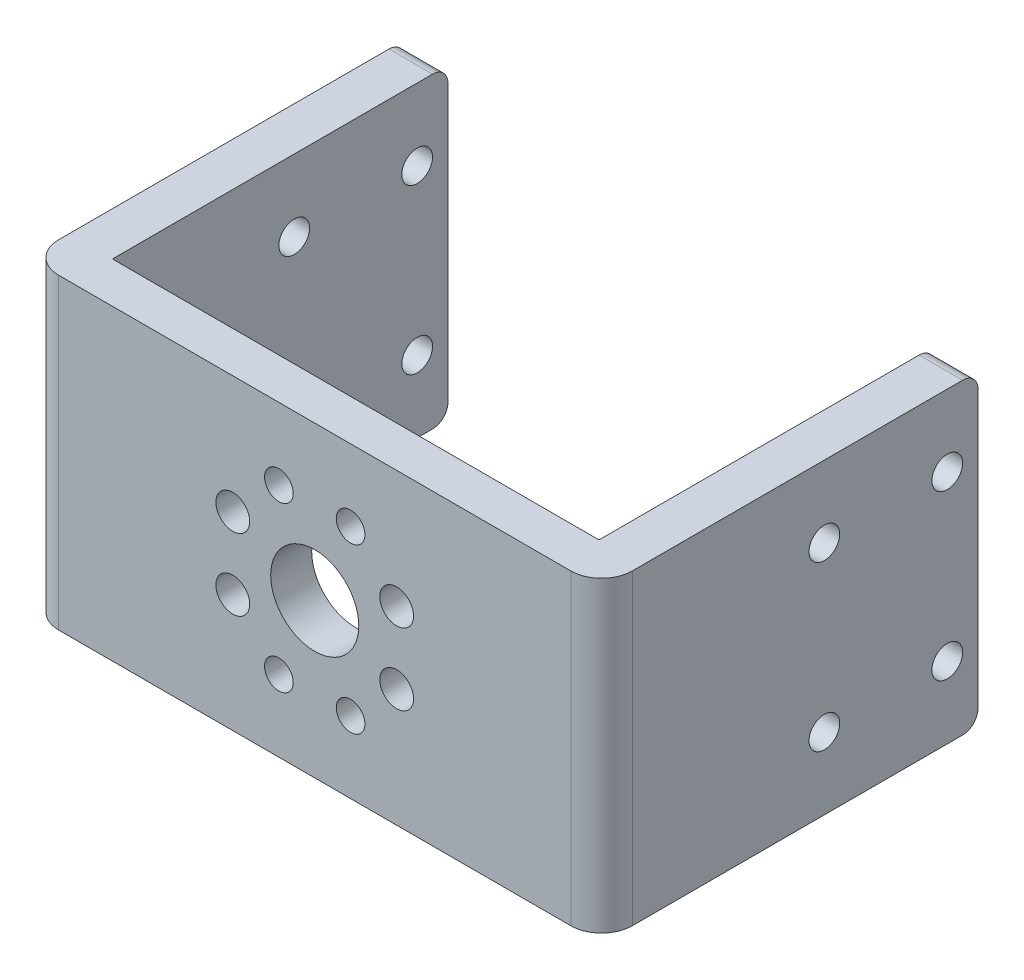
ISO-10303-21;
HEADER;
FILE_DESCRIPTION(('STEP AP214'),'2;1');
FILE_NAME('part.step','',(''),(''),'','','');
FILE_SCHEMA(('AUTOMOTIVE_DESIGN { 1 0 10303 214 1 1 1 1 }'));
ENDSEC;
DATA;
#1=APPLICATION_CONTEXT('core data for automotive mechanical design processes');
#2=APPLICATION_PROTOCOL_DEFINITION('international standard','automotive_design',2000,#1);
#3=PRODUCT_CONTEXT('',#1,'mechanical');
#4=PRODUCT('Part','Part','',(#3));
#5=PRODUCT_RELATED_PRODUCT_CATEGORY('part','',(#4));
#6=PRODUCT_DEFINITION_FORMATION('','',#4);
#7=PRODUCT_DEFINITION_CONTEXT('part definition',#1,'design');
#8=PRODUCT_DEFINITION('design','',#6,#7);
#9=PRODUCT_DEFINITION_SHAPE('','',#8);
#10=(LENGTH_UNIT() NAMED_UNIT(*) SI_UNIT(.MILLI.,.METRE.));
#11=(NAMED_UNIT(*) PLANE_ANGLE_UNIT() SI_UNIT($,.RADIAN.));
#12=(NAMED_UNIT(*) SI_UNIT($,.STERADIAN.) SOLID_ANGLE_UNIT());
#13=UNCERTAINTY_MEASURE_WITH_UNIT(LENGTH_MEASURE(1.E-05),#10,'distance_accuracy_value','');
#14=(GEOMETRIC_REPRESENTATION_CONTEXT(3) GLOBAL_UNCERTAINTY_ASSIGNED_CONTEXT((#13)) GLOBAL_UNIT_ASSIGNED_CONTEXT((#10,
#11,#12)) REPRESENTATION_CONTEXT('',''));
#15=CARTESIAN_POINT('',(0.,0.,0.));
#16=DIRECTION('',(0.,0.,1.));
#17=DIRECTION('',(1.,0.,0.));
#18=AXIS2_PLACEMENT_3D('',#15,#16,#17);
#19=CARTESIAN_POINT('',(23.75,13.5,-32.75));
#20=DIRECTION('',(-1.,0.,0.));
#21=DIRECTION('',(0.,0.,1.));
#22=AXIS2_PLACEMENT_3D('',#19,#20,#21);
#23=PLANE('',#22);
#24=CARTESIAN_POINT('',(23.75,-8.,-31.25));
#25=DIRECTION('',(-1.,0.,0.));
#26=DIRECTION('',(0.,0.,1.));
#27=AXIS2_PLACEMENT_3D('',#24,#25,#26);
#28=CIRCLE('',#27,1.5);
#29=CARTESIAN_POINT('',(23.75,-8.,-29.75));
#30=VERTEX_POINT('',#29);
#31=EDGE_CURVE('E380',#30,#30,#28,.T.);
#32=ORIENTED_EDGE('',*,*,#31,.F.);
#33=EDGE_LOOP('',(#32));
#34=FACE_BOUND('',#33,.T.);
#35=CARTESIAN_POINT('',(23.75,8.,-19.25));
#36=DIRECTION('',(-1.,0.,0.));
#37=DIRECTION('',(0.,0.,1.));
#38=AXIS2_PLACEMENT_3D('',#35,#36,#37);
#39=CIRCLE('',#38,1.5);
#40=CARTESIAN_POINT('',(23.75,8.,-17.75));
#41=VERTEX_POINT('',#40);
#42=EDGE_CURVE('E218',#41,#41,#39,.T.);
#43=ORIENTED_EDGE('',*,*,#42,.F.);
#44=EDGE_LOOP('',(#43));
#45=FACE_BOUND('',#44,.T.);
#46=CARTESIAN_POINT('',(23.75,-8.,-19.25));
#47=DIRECTION('',(-1.,0.,0.));
#48=DIRECTION('',(0.,0.,1.));
#49=AXIS2_PLACEMENT_3D('',#46,#47,#48);
#50=CIRCLE('',#49,1.5);
#51=CARTESIAN_POINT('',(23.75,-8.,-17.75));
#52=VERTEX_POINT('',#51);
#53=EDGE_CURVE('E222',#52,#52,#50,.T.);
#54=ORIENTED_EDGE('',*,*,#53,.F.);
#55=EDGE_LOOP('',(#54));
#56=FACE_BOUND('',#55,.T.);
#57=CARTESIAN_POINT('',(23.75,8.,-31.25));
#58=DIRECTION('',(-1.,0.,0.));
#59=DIRECTION('',(0.,0.,1.));
#60=AXIS2_PLACEMENT_3D('',#57,#58,#59);
#61=CIRCLE('',#60,1.5);
#62=CARTESIAN_POINT('',(23.75,8.,-29.75));
#63=VERTEX_POINT('',#62);
#64=EDGE_CURVE('E435',#63,#63,#61,.T.);
#65=ORIENTED_EDGE('',*,*,#64,.F.);
#66=EDGE_LOOP('',(#65));
#67=FACE_BOUND('',#66,.T.);
#68=DIRECTION('',(0.,1.,0.));
#69=VECTOR('',#68,1.);
#70=CARTESIAN_POINT('',(23.75,-15.,-1.5));
#71=LINE('',#70,#69);
#72=CARTESIAN_POINT('',(23.75,-15.,-1.5));
#73=VERTEX_POINT('',#72);
#74=CARTESIAN_POINT('',(23.75,15.,-1.5));
#75=VERTEX_POINT('',#74);
#76=EDGE_CURVE('E293',#73,#75,#71,.T.);
#77=ORIENTED_EDGE('',*,*,#76,.T.);
#78=DIRECTION('',(0.,0.,-1.));
#79=VECTOR('',#78,1.);
#80=CARTESIAN_POINT('',(23.75,15.,-1.5));
#81=LINE('',#80,#79);
#82=CARTESIAN_POINT('',(23.75,15.,-32.75));
#83=VERTEX_POINT('',#82);
#84=EDGE_CURVE('E242',#75,#83,#81,.T.);
#85=ORIENTED_EDGE('',*,*,#84,.T.);
#86=CARTESIAN_POINT('',(23.75,13.5,-32.75));
#87=DIRECTION('',(-1.,0.,0.));
#88=DIRECTION('',(0.,0.,1.));
#89=AXIS2_PLACEMENT_3D('',#86,#87,#88);
#90=CIRCLE('',#89,1.5);
#91=CARTESIAN_POINT('',(23.75,13.5,-34.25));
#92=VERTEX_POINT('',#91);
#93=EDGE_CURVE('E49',#83,#92,#90,.T.);
#94=ORIENTED_EDGE('',*,*,#93,.T.);
#95=DIRECTION('',(0.,-1.,0.));
#96=VECTOR('',#95,1.);
#97=CARTESIAN_POINT('',(23.75,13.5,-34.25));
#98=LINE('',#97,#96);
#99=CARTESIAN_POINT('',(23.75,-13.5,-34.25));
#100=VERTEX_POINT('',#99);
#101=EDGE_CURVE('E274',#92,#100,#98,.T.);
#102=ORIENTED_EDGE('',*,*,#101,.T.);
#103=CARTESIAN_POINT('',(23.75,-13.5,-32.75));
#104=DIRECTION('',(-1.,0.,0.));
#105=DIRECTION('',(0.,0.,1.));
#106=AXIS2_PLACEMENT_3D('',#103,#104,#105);
#107=CIRCLE('',#106,1.5);
#108=CARTESIAN_POINT('',(23.75,-15.,-32.75));
#109=VERTEX_POINT('',#108);
#110=EDGE_CURVE('E280',#100,#109,#107,.T.);
#111=ORIENTED_EDGE('',*,*,#110,.T.);
#112=DIRECTION('',(0.,0.,1.));
#113=VECTOR('',#112,1.);
#114=CARTESIAN_POINT('',(23.75,-15.,-32.75));
#115=LINE('',#114,#113);
#116=EDGE_CURVE('E213',#109,#73,#115,.T.);
#117=ORIENTED_EDGE('',*,*,#116,.T.);
#118=EDGE_LOOP('',(#77,#85,#94,#102,#111,#117));
#119=FACE_BOUND('',#118,.T.);
#120=ADVANCED_FACE('F17',(#34,#45,#56,#67,#119),#23,.T.);
#121=CARTESIAN_POINT('',(-23.75,-13.5,-32.75));
#122=DIRECTION('',(1.,0.,0.));
#123=DIRECTION('',(0.,1.,0.));
#124=AXIS2_PLACEMENT_3D('',#121,#122,#123);
#125=PLANE('',#124);
#126=CARTESIAN_POINT('',(-23.75,-8.,-19.25));
#127=DIRECTION('',(1.,0.,0.));
#128=DIRECTION('',(0.,0.,-1.));
#129=AXIS2_PLACEMENT_3D('',#126,#127,#128);
#130=CIRCLE('',#129,1.5);
#131=CARTESIAN_POINT('',(-23.75,-8.,-20.75));
#132=VERTEX_POINT('',#131);
#133=EDGE_CURVE('E201',#132,#132,#130,.T.);
#134=ORIENTED_EDGE('',*,*,#133,.F.);
#135=EDGE_LOOP('',(#134));
#136=FACE_BOUND('',#135,.T.);
#137=CARTESIAN_POINT('',(-23.75,8.,-31.25));
#138=DIRECTION('',(1.,0.,0.));
#139=DIRECTION('',(0.,0.,-1.));
#140=AXIS2_PLACEMENT_3D('',#137,#138,#139);
#141=CIRCLE('',#140,1.5);
#142=CARTESIAN_POINT('',(-23.75,8.,-32.75));
#143=VERTEX_POINT('',#142);
#144=EDGE_CURVE('E195',#143,#143,#141,.T.);
#145=ORIENTED_EDGE('',*,*,#144,.F.);
#146=EDGE_LOOP('',(#145));
#147=FACE_BOUND('',#146,.T.);
#148=CARTESIAN_POINT('',(-23.75,8.,-19.25));
#149=DIRECTION('',(1.,0.,0.));
#150=DIRECTION('',(0.,0.,-1.));
#151=AXIS2_PLACEMENT_3D('',#148,#149,#150);
#152=CIRCLE('',#151,1.5);
#153=CARTESIAN_POINT('',(-23.75,8.,-20.75));
#154=VERTEX_POINT('',#153);
#155=EDGE_CURVE('E202',#154,#154,#152,.T.);
#156=ORIENTED_EDGE('',*,*,#155,.F.);
#157=EDGE_LOOP('',(#156));
#158=FACE_BOUND('',#157,.T.);
#159=CARTESIAN_POINT('',(-23.75,-8.,-31.25));
#160=DIRECTION('',(1.,0.,0.));
#161=DIRECTION('',(0.,0.,-1.));
#162=AXIS2_PLACEMENT_3D('',#159,#160,#161);
#163=CIRCLE('',#162,1.5);
#164=CARTESIAN_POINT('',(-23.75,-8.,-32.75));
#165=VERTEX_POINT('',#164);
#166=EDGE_CURVE('E398',#165,#165,#163,.T.);
#167=ORIENTED_EDGE('',*,*,#166,.F.);
#168=EDGE_LOOP('',(#167));
#169=FACE_BOUND('',#168,.T.);
#170=DIRECTION('',(0.,-1.,0.));
#171=VECTOR('',#170,1.);
#172=CARTESIAN_POINT('',(-23.75,15.,-1.5));
#173=LINE('',#172,#171);
#174=CARTESIAN_POINT('',(-23.75,15.,-1.5));
#175=VERTEX_POINT('',#174);
#176=CARTESIAN_POINT('',(-23.75,-15.,-1.5));
#177=VERTEX_POINT('',#176);
#178=EDGE_CURVE('E296',#175,#177,#173,.T.);
#179=ORIENTED_EDGE('',*,*,#178,.T.);
#180=DIRECTION('',(0.,0.,-1.));
#181=VECTOR('',#180,1.);
#182=CARTESIAN_POINT('',(-23.75,-15.,-1.5));
#183=LINE('',#182,#181);
#184=CARTESIAN_POINT('',(-23.75,-15.,-32.75));
#185=VERTEX_POINT('',#184);
#186=EDGE_CURVE('E263',#177,#185,#183,.T.);
#187=ORIENTED_EDGE('',*,*,#186,.T.);
#188=CARTESIAN_POINT('',(-23.75,-13.5,-32.75));
#189=DIRECTION('',(1.,0.,0.));
#190=DIRECTION('',(0.,0.,-1.));
#191=AXIS2_PLACEMENT_3D('',#188,#189,#190);
#192=CIRCLE('',#191,1.5);
#193=CARTESIAN_POINT('',(-23.75,-13.5,-34.25));
#194=VERTEX_POINT('',#193);
#195=EDGE_CURVE('E227',#185,#194,#192,.T.);
#196=ORIENTED_EDGE('',*,*,#195,.T.);
#197=DIRECTION('',(0.,1.,0.));
#198=VECTOR('',#197,1.);
#199=CARTESIAN_POINT('',(-23.75,-13.5,-34.25));
#200=LINE('',#199,#198);
#201=CARTESIAN_POINT('',(-23.75,13.5,-34.25));
#202=VERTEX_POINT('',#201);
#203=EDGE_CURVE('E317',#194,#202,#200,.T.);
#204=ORIENTED_EDGE('',*,*,#203,.T.);
#205=CARTESIAN_POINT('',(-23.75,13.5,-32.75));
#206=DIRECTION('',(1.,0.,0.));
#207=DIRECTION('',(0.,0.,-1.));
#208=AXIS2_PLACEMENT_3D('',#205,#206,#207);
#209=CIRCLE('',#208,1.5);
#210=CARTESIAN_POINT('',(-23.75,15.,-32.75));
#211=VERTEX_POINT('',#210);
#212=EDGE_CURVE('E299',#202,#211,#209,.T.);
#213=ORIENTED_EDGE('',*,*,#212,.T.);
#214=DIRECTION('',(0.,0.,1.));
#215=VECTOR('',#214,1.);
#216=CARTESIAN_POINT('',(-23.75,15.,-32.75));
#217=LINE('',#216,#215);
#218=EDGE_CURVE('E241',#211,#175,#217,.T.);
#219=ORIENTED_EDGE('',*,*,#218,.T.);
#220=EDGE_LOOP('',(#179,#187,#196,#204,#213,#219));
#221=FACE_BOUND('',#220,.T.);
#222=ADVANCED_FACE('F496',(#136,#147,#158,#169,#221),#125,.T.);
#223=CARTESIAN_POINT('',(25.,0.,-0.5));
#224=DIRECTION('',(0.,1.,0.));
#225=DIRECTION('',(0.,0.,1.));
#226=AXIS2_PLACEMENT_3D('',#223,#224,#225);
#227=CYLINDRICAL_SURFACE('',#226,3.);
#228=CARTESIAN_POINT('',(25.,-15.,-0.5));
#229=DIRECTION('',(0.,-1.,0.));
#230=DIRECTION('',(0.,0.,-1.));
#231=AXIS2_PLACEMENT_3D('',#228,#229,#230);
#232=CIRCLE('',#231,3.);
#233=CARTESIAN_POINT('',(28.,-15.,-0.5));
#234=VERTEX_POINT('',#233);
#235=CARTESIAN_POINT('',(25.,-15.,2.5));
#236=VERTEX_POINT('',#235);
#237=EDGE_CURVE('E191',#234,#236,#232,.T.);
#238=ORIENTED_EDGE('',*,*,#237,.F.);
#239=DIRECTION('',(0.,-1.,0.));
#240=VECTOR('',#239,1.);
#241=CARTESIAN_POINT('',(28.,-13.5,-0.5));
#242=LINE('',#241,#240);
#243=CARTESIAN_POINT('',(28.,15.,-0.5));
#244=VERTEX_POINT('',#243);
#245=EDGE_CURVE('E166',#244,#234,#242,.T.);
#246=ORIENTED_EDGE('',*,*,#245,.F.);
#247=CARTESIAN_POINT('',(25.,15.,-0.5));
#248=DIRECTION('',(0.,1.,0.));
#249=DIRECTION('',(0.,0.,1.));
#250=AXIS2_PLACEMENT_3D('',#247,#248,#249);
#251=CIRCLE('',#250,3.);
#252=CARTESIAN_POINT('',(25.,15.,2.5));
#253=VERTEX_POINT('',#252);
#254=EDGE_CURVE('E247',#253,#244,#251,.T.);
#255=ORIENTED_EDGE('',*,*,#254,.F.);
#256=DIRECTION('',(0.,1.,0.));
#257=VECTOR('',#256,1.);
#258=CARTESIAN_POINT('',(25.,0.,2.5));
#259=LINE('',#258,#257);
#260=EDGE_CURVE('E11',#236,#253,#259,.T.);
#261=ORIENTED_EDGE('',*,*,#260,.F.);
#262=EDGE_LOOP('',(#238,#246,#255,#261));
#263=FACE_BOUND('',#262,.T.);
#264=ADVANCED_FACE('F501',(#263),#227,.T.);
#265=CARTESIAN_POINT('',(-25.,0.,-0.5));
#266=DIRECTION('',(0.,-1.,0.));
#267=DIRECTION('',(0.,0.,-1.));
#268=AXIS2_PLACEMENT_3D('',#265,#266,#267);
#269=CYLINDRICAL_SURFACE('',#268,3.);
#270=CARTESIAN_POINT('',(-25.,15.,-0.5));
#271=DIRECTION('',(0.,1.,0.));
#272=DIRECTION('',(0.,0.,1.));
#273=AXIS2_PLACEMENT_3D('',#270,#271,#272);
#274=CIRCLE('',#273,3.);
#275=CARTESIAN_POINT('',(-28.,15.,-0.5));
#276=VERTEX_POINT('',#275);
#277=CARTESIAN_POINT('',(-25.,15.,2.5));
#278=VERTEX_POINT('',#277);
#279=EDGE_CURVE('E161',#276,#278,#274,.T.);
#280=ORIENTED_EDGE('',*,*,#279,.F.);
#281=DIRECTION('',(0.,1.,0.));
#282=VECTOR('',#281,1.);
#283=CARTESIAN_POINT('',(-28.,13.5,-0.5));
#284=LINE('',#283,#282);
#285=CARTESIAN_POINT('',(-28.,-15.,-0.5));
#286=VERTEX_POINT('',#285);
#287=EDGE_CURVE('E154',#286,#276,#284,.T.);
#288=ORIENTED_EDGE('',*,*,#287,.F.);
#289=CARTESIAN_POINT('',(-25.,-15.,-0.5));
#290=DIRECTION('',(0.,-1.,0.));
#291=DIRECTION('',(0.,0.,-1.));
#292=AXIS2_PLACEMENT_3D('',#289,#290,#291);
#293=CIRCLE('',#292,3.);
#294=CARTESIAN_POINT('',(-25.,-15.,2.5));
#295=VERTEX_POINT('',#294);
#296=EDGE_CURVE('E158',#295,#286,#293,.T.);
#297=ORIENTED_EDGE('',*,*,#296,.F.);
#298=DIRECTION('',(0.,-1.,0.));
#299=VECTOR('',#298,1.);
#300=CARTESIAN_POINT('',(-25.,0.,2.5));
#301=LINE('',#300,#299);
#302=EDGE_CURVE('E25',#278,#295,#301,.T.);
#303=ORIENTED_EDGE('',*,*,#302,.F.);
#304=EDGE_LOOP('',(#280,#288,#297,#303));
#305=FACE_BOUND('',#304,.T.);
#306=ADVANCED_FACE('F156',(#305),#269,.T.);
#307=CARTESIAN_POINT('',(0.,0.,2.5));
#308=DIRECTION('',(0.,0.,1.));
#309=DIRECTION('',(1.,0.,0.));
#310=AXIS2_PLACEMENT_3D('',#307,#308,#309);
#311=PLANE('',#310);
#312=CARTESIAN_POINT('',(-8.,3.5,2.5));
#313=DIRECTION('',(0.,0.,-1.));
#314=DIRECTION('',(1.,0.,0.));
#315=AXIS2_PLACEMENT_3D('',#312,#313,#314);
#316=CIRCLE('',#315,1.65);
#317=CARTESIAN_POINT('',(-6.35,3.5,2.5));
#318=VERTEX_POINT('',#317);
#319=EDGE_CURVE('E347',#318,#318,#316,.T.);
#320=ORIENTED_EDGE('',*,*,#319,.T.);
#321=EDGE_LOOP('',(#320));
#322=FACE_BOUND('',#321,.T.);
#323=CARTESIAN_POINT('',(-3.5,-8.,2.5));
#324=DIRECTION('',(0.,0.,-1.));
#325=DIRECTION('',(1.,0.,0.));
#326=AXIS2_PLACEMENT_3D('',#323,#324,#325);
#327=CIRCLE('',#326,1.4);
#328=CARTESIAN_POINT('',(-2.1,-8.,2.5));
#329=VERTEX_POINT('',#328);
#330=EDGE_CURVE('E353',#329,#329,#327,.T.);
#331=ORIENTED_EDGE('',*,*,#330,.T.);
#332=EDGE_LOOP('',(#331));
#333=FACE_BOUND('',#332,.T.);
#334=CARTESIAN_POINT('',(3.5,8.,2.5));
#335=DIRECTION('',(0.,0.,-1.));
#336=DIRECTION('',(1.,0.,0.));
#337=AXIS2_PLACEMENT_3D('',#334,#335,#336);
#338=CIRCLE('',#337,1.4);
#339=CARTESIAN_POINT('',(4.9,8.,2.5));
#340=VERTEX_POINT('',#339);
#341=EDGE_CURVE('E367',#340,#340,#338,.T.);
#342=ORIENTED_EDGE('',*,*,#341,.T.);
#343=EDGE_LOOP('',(#342));
#344=FACE_BOUND('',#343,.T.);
#345=CARTESIAN_POINT('',(0.,0.,2.5));
#346=DIRECTION('',(0.,0.,-1.));
#347=DIRECTION('',(1.,0.,0.));
#348=AXIS2_PLACEMENT_3D('',#345,#346,#347);
#349=CIRCLE('',#348,4.3);
#350=CARTESIAN_POINT('',(4.3,0.,2.5));
#351=VERTEX_POINT('',#350);
#352=EDGE_CURVE('E409',#351,#351,#349,.T.);
#353=ORIENTED_EDGE('',*,*,#352,.T.);
#354=EDGE_LOOP('',(#353));
#355=FACE_BOUND('',#354,.T.);
#356=CARTESIAN_POINT('',(3.5,-8.,2.5));
#357=DIRECTION('',(0.,0.,-1.));
#358=DIRECTION('',(1.,0.,0.));
#359=AXIS2_PLACEMENT_3D('',#356,#357,#358);
#360=CIRCLE('',#359,1.4);
#361=CARTESIAN_POINT('',(4.9,-8.,2.5));
#362=VERTEX_POINT('',#361);
#363=EDGE_CURVE('E419',#362,#362,#360,.T.);
#364=ORIENTED_EDGE('',*,*,#363,.T.);
#365=EDGE_LOOP('',(#364));
#366=FACE_BOUND('',#365,.T.);
#367=CARTESIAN_POINT('',(8.,-3.5,2.5));
#368=DIRECTION('',(0.,0.,-1.));
#369=DIRECTION('',(1.,0.,0.));
#370=AXIS2_PLACEMENT_3D('',#367,#368,#369);
#371=CIRCLE('',#370,1.65);
#372=CARTESIAN_POINT('',(9.65,-3.5,2.5));
#373=VERTEX_POINT('',#372);
#374=EDGE_CURVE('E427',#373,#373,#371,.T.);
#375=ORIENTED_EDGE('',*,*,#374,.T.);
#376=EDGE_LOOP('',(#375));
#377=FACE_BOUND('',#376,.T.);
#378=CARTESIAN_POINT('',(8.,3.5,2.5));
#379=DIRECTION('',(0.,0.,-1.));
#380=DIRECTION('',(1.,0.,0.));
#381=AXIS2_PLACEMENT_3D('',#378,#379,#380);
#382=CIRCLE('',#381,1.65);
#383=CARTESIAN_POINT('',(9.65,3.5,2.5));
#384=VERTEX_POINT('',#383);
#385=EDGE_CURVE('E366',#384,#384,#382,.T.);
#386=ORIENTED_EDGE('',*,*,#385,.T.);
#387=EDGE_LOOP('',(#386));
#388=FACE_BOUND('',#387,.T.);
#389=CARTESIAN_POINT('',(-3.5,8.,2.5));
#390=DIRECTION('',(0.,0.,-1.));
#391=DIRECTION('',(1.,0.,0.));
#392=AXIS2_PLACEMENT_3D('',#389,#390,#391);
#393=CIRCLE('',#392,1.4);
#394=CARTESIAN_POINT('',(-2.1,8.,2.5));
#395=VERTEX_POINT('',#394);
#396=EDGE_CURVE('E374',#395,#395,#393,.T.);
#397=ORIENTED_EDGE('',*,*,#396,.T.);
#398=EDGE_LOOP('',(#397));
#399=FACE_BOUND('',#398,.T.);
#400=CARTESIAN_POINT('',(-8.,-3.5,2.5));
#401=DIRECTION('',(0.,0.,-1.));
#402=DIRECTION('',(1.,0.,0.));
#403=AXIS2_PLACEMENT_3D('',#400,#401,#402);
#404=CIRCLE('',#403,1.65);
#405=CARTESIAN_POINT('',(-6.35,-3.5,2.5));
#406=VERTEX_POINT('',#405);
#407=EDGE_CURVE('E354',#406,#406,#404,.T.);
#408=ORIENTED_EDGE('',*,*,#407,.T.);
#409=EDGE_LOOP('',(#408));
#410=FACE_BOUND('',#409,.T.);
#411=DIRECTION('',(-1.,0.,0.));
#412=VECTOR('',#411,1.);
#413=CARTESIAN_POINT('',(0.,15.,2.5));
#414=LINE('',#413,#412);
#415=EDGE_CURVE('E252',#253,#278,#414,.T.);
#416=ORIENTED_EDGE('',*,*,#415,.T.);
#417=ORIENTED_EDGE('',*,*,#302,.T.);
#418=DIRECTION('',(1.,0.,0.));
#419=VECTOR('',#418,1.);
#420=CARTESIAN_POINT('',(0.,-15.,2.5));
#421=LINE('',#420,#419);
#422=EDGE_CURVE('E183',#295,#236,#421,.T.);
#423=ORIENTED_EDGE('',*,*,#422,.T.);
#424=ORIENTED_EDGE('',*,*,#260,.T.);
#425=EDGE_LOOP('',(#416,#417,#423,#424));
#426=FACE_BOUND('',#425,.T.);
#427=ADVANCED_FACE('F333',(#322,#333,#344,#355,#366,#377,#388,#399,#410,#426),#311,.T.);
#428=CARTESIAN_POINT('',(-28.,13.5,-32.75));
#429=DIRECTION('',(-1.,0.,0.));
#430=DIRECTION('',(0.,0.,1.));
#431=AXIS2_PLACEMENT_3D('',#428,#429,#430);
#432=PLANE('',#431);
#433=CARTESIAN_POINT('',(-28.,8.,-19.25));
#434=DIRECTION('',(-1.,0.,0.));
#435=DIRECTION('',(0.,0.,1.));
#436=AXIS2_PLACEMENT_3D('',#433,#434,#435);
#437=CIRCLE('',#436,1.5);
#438=CARTESIAN_POINT('',(-28.,8.,-17.75));
#439=VERTEX_POINT('',#438);
#440=EDGE_CURVE('E214',#439,#439,#437,.T.);
#441=ORIENTED_EDGE('',*,*,#440,.F.);
#442=EDGE_LOOP('',(#441));
#443=FACE_BOUND('',#442,.T.);
#444=CARTESIAN_POINT('',(-28.,-8.,-31.25));
#445=DIRECTION('',(-1.,0.,0.));
#446=DIRECTION('',(0.,0.,1.));
#447=AXIS2_PLACEMENT_3D('',#444,#445,#446);
#448=CIRCLE('',#447,1.5);
#449=CARTESIAN_POINT('',(-28.,-8.,-29.75));
#450=VERTEX_POINT('',#449);
#451=EDGE_CURVE('E394',#450,#450,#448,.T.);
#452=ORIENTED_EDGE('',*,*,#451,.F.);
#453=EDGE_LOOP('',(#452));
#454=FACE_BOUND('',#453,.T.);
#455=CARTESIAN_POINT('',(-28.,-8.,-19.25));
#456=DIRECTION('',(-1.,0.,0.));
#457=DIRECTION('',(0.,0.,1.));
#458=AXIS2_PLACEMENT_3D('',#455,#456,#457);
#459=CIRCLE('',#458,1.5);
#460=CARTESIAN_POINT('',(-28.,-8.,-17.75));
#461=VERTEX_POINT('',#460);
#462=EDGE_CURVE('E197',#461,#461,#459,.T.);
#463=ORIENTED_EDGE('',*,*,#462,.F.);
#464=EDGE_LOOP('',(#463));
#465=FACE_BOUND('',#464,.T.);
#466=CARTESIAN_POINT('',(-28.,8.,-31.25));
#467=DIRECTION('',(-1.,0.,0.));
#468=DIRECTION('',(0.,0.,1.));
#469=AXIS2_PLACEMENT_3D('',#466,#467,#468);
#470=CIRCLE('',#469,1.5);
#471=CARTESIAN_POINT('',(-28.,8.,-29.75));
#472=VERTEX_POINT('',#471);
#473=EDGE_CURVE('E203',#472,#472,#470,.T.);
#474=ORIENTED_EDGE('',*,*,#473,.F.);
#475=EDGE_LOOP('',(#474));
#476=FACE_BOUND('',#475,.T.);
#477=DIRECTION('',(0.,0.,1.));
#478=VECTOR('',#477,1.);
#479=CARTESIAN_POINT('',(-28.,-15.,-32.75));
#480=LINE('',#479,#478);
#481=CARTESIAN_POINT('',(-28.,-15.,-32.75));
#482=VERTEX_POINT('',#481);
#483=EDGE_CURVE('E169',#482,#286,#480,.T.);
#484=ORIENTED_EDGE('',*,*,#483,.T.);
#485=ORIENTED_EDGE('',*,*,#287,.T.);
#486=DIRECTION('',(0.,0.,-1.));
#487=VECTOR('',#486,1.);
#488=CARTESIAN_POINT('',(-28.,15.,0.));
#489=LINE('',#488,#487);
#490=CARTESIAN_POINT('',(-28.,15.,-32.75));
#491=VERTEX_POINT('',#490);
#492=EDGE_CURVE('E256',#276,#491,#489,.T.);
#493=ORIENTED_EDGE('',*,*,#492,.T.);
#494=CARTESIAN_POINT('',(-28.,13.5,-32.75));
#495=DIRECTION('',(-1.,0.,0.));
#496=DIRECTION('',(0.,0.,1.));
#497=AXIS2_PLACEMENT_3D('',#494,#495,#496);
#498=CIRCLE('',#497,1.5);
#499=CARTESIAN_POINT('',(-28.,13.5,-34.25));
#500=VERTEX_POINT('',#499);
#501=EDGE_CURVE('E306',#491,#500,#498,.T.);
#502=ORIENTED_EDGE('',*,*,#501,.T.);
#503=DIRECTION('',(0.,-1.,0.));
#504=VECTOR('',#503,1.);
#505=CARTESIAN_POINT('',(-28.,13.5,-34.25));
#506=LINE('',#505,#504);
#507=CARTESIAN_POINT('',(-28.,-13.5,-34.25));
#508=VERTEX_POINT('',#507);
#509=EDGE_CURVE('E230',#500,#508,#506,.T.);
#510=ORIENTED_EDGE('',*,*,#509,.T.);
#511=CARTESIAN_POINT('',(-28.,-13.5,-32.75));
#512=DIRECTION('',(-1.,0.,0.));
#513=DIRECTION('',(0.,0.,1.));
#514=AXIS2_PLACEMENT_3D('',#511,#512,#513);
#515=CIRCLE('',#514,1.5);
#516=EDGE_CURVE('E172',#508,#482,#515,.T.);
#517=ORIENTED_EDGE('',*,*,#516,.T.);
#518=EDGE_LOOP('',(#484,#485,#493,#502,#510,#517));
#519=FACE_BOUND('',#518,.T.);
#520=ADVANCED_FACE('F170',(#443,#454,#465,#476,#519),#432,.T.);
#521=CARTESIAN_POINT('',(28.,-13.5,-32.75));
#522=DIRECTION('',(1.,0.,0.));
#523=DIRECTION('',(0.,1.,0.));
#524=AXIS2_PLACEMENT_3D('',#521,#522,#523);
#525=PLANE('',#524);
#526=CARTESIAN_POINT('',(28.,8.,-19.25));
#527=DIRECTION('',(1.,0.,0.));
#528=DIRECTION('',(0.,0.,-1.));
#529=AXIS2_PLACEMENT_3D('',#526,#527,#528);
#530=CIRCLE('',#529,1.5);
#531=CARTESIAN_POINT('',(28.,8.,-20.75));
#532=VERTEX_POINT('',#531);
#533=EDGE_CURVE('E226',#532,#532,#530,.T.);
#534=ORIENTED_EDGE('',*,*,#533,.F.);
#535=EDGE_LOOP('',(#534));
#536=FACE_BOUND('',#535,.T.);
#537=CARTESIAN_POINT('',(28.,8.,-31.25));
#538=DIRECTION('',(1.,0.,0.));
#539=DIRECTION('',(0.,0.,-1.));
#540=AXIS2_PLACEMENT_3D('',#537,#538,#539);
#541=CIRCLE('',#540,1.5);
#542=CARTESIAN_POINT('',(28.,8.,-32.75));
#543=VERTEX_POINT('',#542);
#544=EDGE_CURVE('E385',#543,#543,#541,.T.);
#545=ORIENTED_EDGE('',*,*,#544,.F.);
#546=EDGE_LOOP('',(#545));
#547=FACE_BOUND('',#546,.T.);
#548=CARTESIAN_POINT('',(28.,-8.,-31.25));
#549=DIRECTION('',(1.,0.,0.));
#550=DIRECTION('',(0.,0.,-1.));
#551=AXIS2_PLACEMENT_3D('',#548,#549,#550);
#552=CIRCLE('',#551,1.5);
#553=CARTESIAN_POINT('',(28.,-8.,-32.75));
#554=VERTEX_POINT('',#553);
#555=EDGE_CURVE('E384',#554,#554,#552,.T.);
#556=ORIENTED_EDGE('',*,*,#555,.F.);
#557=EDGE_LOOP('',(#556));
#558=FACE_BOUND('',#557,.T.);
#559=CARTESIAN_POINT('',(28.,-8.,-19.25));
#560=DIRECTION('',(1.,0.,0.));
#561=DIRECTION('',(0.,0.,-1.));
#562=AXIS2_PLACEMENT_3D('',#559,#560,#561);
#563=CIRCLE('',#562,1.5);
#564=CARTESIAN_POINT('',(28.,-8.,-20.75));
#565=VERTEX_POINT('',#564);
#566=EDGE_CURVE('E207',#565,#565,#563,.T.);
#567=ORIENTED_EDGE('',*,*,#566,.F.);
#568=EDGE_LOOP('',(#567));
#569=FACE_BOUND('',#568,.T.);
#570=DIRECTION('',(0.,0.,1.));
#571=VECTOR('',#570,1.);
#572=CARTESIAN_POINT('',(28.,15.,-32.75));
#573=LINE('',#572,#571);
#574=CARTESIAN_POINT('',(28.,15.,-32.75));
#575=VERTEX_POINT('',#574);
#576=EDGE_CURVE('E251',#575,#244,#573,.T.);
#577=ORIENTED_EDGE('',*,*,#576,.T.);
#578=ORIENTED_EDGE('',*,*,#245,.T.);
#579=DIRECTION('',(0.,0.,-1.));
#580=VECTOR('',#579,1.);
#581=CARTESIAN_POINT('',(28.,-15.,0.));
#582=LINE('',#581,#580);
#583=CARTESIAN_POINT('',(28.,-15.,-32.75));
#584=VERTEX_POINT('',#583);
#585=EDGE_CURVE('E212',#234,#584,#582,.T.);
#586=ORIENTED_EDGE('',*,*,#585,.T.);
#587=CARTESIAN_POINT('',(28.,-13.5,-32.75));
#588=DIRECTION('',(1.,0.,0.));
#589=DIRECTION('',(0.,0.,-1.));
#590=AXIS2_PLACEMENT_3D('',#587,#588,#589);
#591=CIRCLE('',#590,1.5);
#592=CARTESIAN_POINT('',(28.,-13.5,-34.25));
#593=VERTEX_POINT('',#592);
#594=EDGE_CURVE('E322',#584,#593,#591,.T.);
#595=ORIENTED_EDGE('',*,*,#594,.T.);
#596=DIRECTION('',(0.,1.,0.));
#597=VECTOR('',#596,1.);
#598=CARTESIAN_POINT('',(28.,-13.5,-34.25));
#599=LINE('',#598,#597);
#600=CARTESIAN_POINT('',(28.,13.5,-34.25));
#601=VERTEX_POINT('',#600);
#602=EDGE_CURVE('E273',#593,#601,#599,.T.);
#603=ORIENTED_EDGE('',*,*,#602,.T.);
#604=CARTESIAN_POINT('',(28.,13.5,-32.75));
#605=DIRECTION('',(1.,0.,0.));
#606=DIRECTION('',(0.,0.,-1.));
#607=AXIS2_PLACEMENT_3D('',#604,#605,#606);
#608=CIRCLE('',#607,1.5);
#609=EDGE_CURVE('E38',#601,#575,#608,.T.);
#610=ORIENTED_EDGE('',*,*,#609,.T.);
#611=EDGE_LOOP('',(#577,#578,#586,#595,#603,#610));
#612=FACE_BOUND('',#611,.T.);
#613=ADVANCED_FACE('F465',(#536,#547,#558,#569,#612),#525,.T.);
#614=CARTESIAN_POINT('',(-20.4135396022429,13.5,-32.75));
#615=DIRECTION('',(1.,0.,0.));
#616=DIRECTION('',(0.,0.,-1.));
#617=AXIS2_PLACEMENT_3D('',#614,#615,#616);
#618=CYLINDRICAL_SURFACE('',#617,1.5);
#619=DIRECTION('',(1.,0.,0.));
#620=VECTOR('',#619,1.);
#621=CARTESIAN_POINT('',(-20.4135396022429,13.5,-34.25));
#622=LINE('',#621,#620);
#623=EDGE_CURVE('E269',#92,#601,#622,.T.);
#624=ORIENTED_EDGE('',*,*,#623,.F.);
#625=ORIENTED_EDGE('',*,*,#93,.F.);
#626=DIRECTION('',(1.,0.,0.));
#627=VECTOR('',#626,1.);
#628=CARTESIAN_POINT('',(-20.4135396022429,15.,-32.75));
#629=LINE('',#628,#627);
#630=EDGE_CURVE('E290',#83,#575,#629,.T.);
#631=ORIENTED_EDGE('',*,*,#630,.T.);
#632=ORIENTED_EDGE('',*,*,#609,.F.);
#633=EDGE_LOOP('',(#624,#625,#631,#632));
#634=FACE_BOUND('',#633,.T.);
#635=ADVANCED_FACE('F484',(#634),#618,.T.);
#636=CARTESIAN_POINT('',(-20.4135396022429,-13.5,-34.25));
#637=DIRECTION('',(0.,0.,-1.));
#638=DIRECTION('',(0.,-1.,0.));
#639=AXIS2_PLACEMENT_3D('',#636,#637,#638);
#640=PLANE('',#639);
#641=DIRECTION('',(1.,0.,0.));
#642=VECTOR('',#641,1.);
#643=CARTESIAN_POINT('',(-20.4135396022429,-13.5,-34.25));
#644=LINE('',#643,#642);
#645=EDGE_CURVE('E311',#100,#593,#644,.T.);
#646=ORIENTED_EDGE('',*,*,#645,.F.);
#647=ORIENTED_EDGE('',*,*,#101,.F.);
#648=ORIENTED_EDGE('',*,*,#623,.T.);
#649=ORIENTED_EDGE('',*,*,#602,.F.);
#650=EDGE_LOOP('',(#646,#647,#648,#649));
#651=FACE_BOUND('',#650,.T.);
#652=ADVANCED_FACE('F463',(#651),#640,.T.);
#653=CARTESIAN_POINT('',(-20.4135396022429,-13.5,-32.75));
#654=DIRECTION('',(1.,0.,0.));
#655=DIRECTION('',(0.,0.,-1.));
#656=AXIS2_PLACEMENT_3D('',#653,#654,#655);
#657=CYLINDRICAL_SURFACE('',#656,1.5);
#658=DIRECTION('',(1.,0.,0.));
#659=VECTOR('',#658,1.);
#660=CARTESIAN_POINT('',(-20.4135396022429,-15.,-32.75));
#661=LINE('',#660,#659);
#662=EDGE_CURVE('E208',#109,#584,#661,.T.);
#663=ORIENTED_EDGE('',*,*,#662,.F.);
#664=ORIENTED_EDGE('',*,*,#110,.F.);
#665=ORIENTED_EDGE('',*,*,#645,.T.);
#666=ORIENTED_EDGE('',*,*,#594,.F.);
#667=EDGE_LOOP('',(#663,#664,#665,#666));
#668=FACE_BOUND('',#667,.T.);
#669=ADVANCED_FACE('F460',(#668),#657,.T.);
#670=CARTESIAN_POINT('',(8.89756829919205,-13.5,-32.75));
#671=DIRECTION('',(-1.,0.,0.));
#672=DIRECTION('',(0.,0.,1.));
#673=AXIS2_PLACEMENT_3D('',#670,#671,#672);
#674=CYLINDRICAL_SURFACE('',#673,1.5);
#675=DIRECTION('',(-1.,0.,0.));
#676=VECTOR('',#675,1.);
#677=CARTESIAN_POINT('',(8.89756829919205,-13.5,-34.25));
#678=LINE('',#677,#676);
#679=EDGE_CURVE('E318',#194,#508,#678,.T.);
#680=ORIENTED_EDGE('',*,*,#679,.F.);
#681=ORIENTED_EDGE('',*,*,#195,.F.);
#682=DIRECTION('',(-1.,0.,0.));
#683=VECTOR('',#682,1.);
#684=CARTESIAN_POINT('',(8.89756829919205,-15.,-32.75));
#685=LINE('',#684,#683);
#686=EDGE_CURVE('E177',#185,#482,#685,.T.);
#687=ORIENTED_EDGE('',*,*,#686,.T.);
#688=ORIENTED_EDGE('',*,*,#516,.F.);
#689=EDGE_LOOP('',(#680,#681,#687,#688));
#690=FACE_BOUND('',#689,.T.);
#691=ADVANCED_FACE('F559',(#690),#674,.T.);
#692=CARTESIAN_POINT('',(8.89756829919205,0.,-34.25));
#693=DIRECTION('',(0.,0.,1.));
#694=DIRECTION('',(1.,0.,0.));
#695=AXIS2_PLACEMENT_3D('',#692,#693,#694);
#696=PLANE('',#695);
#697=DIRECTION('',(-1.,0.,0.));
#698=VECTOR('',#697,1.);
#699=CARTESIAN_POINT('',(8.89756829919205,13.5,-34.25));
#700=LINE('',#699,#698);
#701=EDGE_CURVE('E302',#202,#500,#700,.T.);
#702=ORIENTED_EDGE('',*,*,#701,.F.);
#703=ORIENTED_EDGE('',*,*,#203,.F.);
#704=ORIENTED_EDGE('',*,*,#679,.T.);
#705=ORIENTED_EDGE('',*,*,#509,.F.);
#706=EDGE_LOOP('',(#702,#703,#704,#705));
#707=FACE_BOUND('',#706,.T.);
#708=ADVANCED_FACE('F530',(#707),#696,.F.);
#709=CARTESIAN_POINT('',(8.89756829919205,13.5,-32.75));
#710=DIRECTION('',(-1.,0.,0.));
#711=DIRECTION('',(0.,0.,1.));
#712=AXIS2_PLACEMENT_3D('',#709,#710,#711);
#713=CYLINDRICAL_SURFACE('',#712,1.5);
#714=DIRECTION('',(-1.,0.,0.));
#715=VECTOR('',#714,1.);
#716=CARTESIAN_POINT('',(8.89756829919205,15.,-32.75));
#717=LINE('',#716,#715);
#718=EDGE_CURVE('E259',#211,#491,#717,.T.);
#719=ORIENTED_EDGE('',*,*,#718,.F.);
#720=ORIENTED_EDGE('',*,*,#212,.F.);
#721=ORIENTED_EDGE('',*,*,#701,.T.);
#722=ORIENTED_EDGE('',*,*,#501,.F.);
#723=EDGE_LOOP('',(#719,#720,#721,#722));
#724=FACE_BOUND('',#723,.T.);
#725=ADVANCED_FACE('F551',(#724),#713,.T.);
#726=CARTESIAN_POINT('',(14.25,15.,-1.5));
#727=DIRECTION('',(0.,0.,1.));
#728=DIRECTION('',(1.,0.,0.));
#729=AXIS2_PLACEMENT_3D('',#726,#727,#728);
#730=PLANE('',#729);
#731=CARTESIAN_POINT('',(8.,-3.5,-1.5));
#732=DIRECTION('',(0.,0.,-1.));
#733=DIRECTION('',(1.,0.,0.));
#734=AXIS2_PLACEMENT_3D('',#731,#732,#733);
#735=CIRCLE('',#734,1.65);
#736=CARTESIAN_POINT('',(9.65,-3.5,-1.5));
#737=VERTEX_POINT('',#736);
#738=EDGE_CURVE('E431',#737,#737,#735,.T.);
#739=ORIENTED_EDGE('',*,*,#738,.F.);
#740=EDGE_LOOP('',(#739));
#741=FACE_BOUND('',#740,.T.);
#742=CARTESIAN_POINT('',(3.5,-8.,-1.5));
#743=DIRECTION('',(0.,0.,-1.));
#744=DIRECTION('',(1.,0.,0.));
#745=AXIS2_PLACEMENT_3D('',#742,#743,#744);
#746=CIRCLE('',#745,1.4);
#747=CARTESIAN_POINT('',(4.9,-8.,-1.5));
#748=VERTEX_POINT('',#747);
#749=EDGE_CURVE('E423',#748,#748,#746,.T.);
#750=ORIENTED_EDGE('',*,*,#749,.F.);
#751=EDGE_LOOP('',(#750));
#752=FACE_BOUND('',#751,.T.);
#753=CARTESIAN_POINT('',(0.,0.,-1.5));
#754=DIRECTION('',(0.,0.,-1.));
#755=DIRECTION('',(-1.,0.,0.));
#756=AXIS2_PLACEMENT_3D('',#753,#754,#755);
#757=CIRCLE('',#756,4.3);
#758=CARTESIAN_POINT('',(-4.3,0.,-1.5));
#759=VERTEX_POINT('',#758);
#760=EDGE_CURVE('E414',#759,#759,#757,.T.);
#761=ORIENTED_EDGE('',*,*,#760,.F.);
#762=EDGE_LOOP('',(#761));
#763=FACE_BOUND('',#762,.T.);
#764=CARTESIAN_POINT('',(8.,3.5,-1.5));
#765=DIRECTION('',(0.,0.,-1.));
#766=DIRECTION('',(-1.,0.,0.));
#767=AXIS2_PLACEMENT_3D('',#764,#765,#766);
#768=CIRCLE('',#767,1.65);
#769=CARTESIAN_POINT('',(6.35,3.5,-1.5));
#770=VERTEX_POINT('',#769);
#771=EDGE_CURVE('E402',#770,#770,#768,.T.);
#772=ORIENTED_EDGE('',*,*,#771,.F.);
#773=EDGE_LOOP('',(#772));
#774=FACE_BOUND('',#773,.T.);
#775=CARTESIAN_POINT('',(3.5,8.,-1.5));
#776=DIRECTION('',(0.,0.,-1.));
#777=DIRECTION('',(-1.,0.,0.));
#778=AXIS2_PLACEMENT_3D('',#775,#776,#777);
#779=CIRCLE('',#778,1.4);
#780=CARTESIAN_POINT('',(2.1,8.,-1.5));
#781=VERTEX_POINT('',#780);
#782=EDGE_CURVE('E362',#781,#781,#779,.T.);
#783=ORIENTED_EDGE('',*,*,#782,.F.);
#784=EDGE_LOOP('',(#783));
#785=FACE_BOUND('',#784,.T.);
#786=CARTESIAN_POINT('',(-3.5,8.,-1.5));
#787=DIRECTION('',(0.,0.,-1.));
#788=DIRECTION('',(1.,0.,0.));
#789=AXIS2_PLACEMENT_3D('',#786,#787,#788);
#790=CIRCLE('',#789,1.4);
#791=CARTESIAN_POINT('',(-2.1,8.,-1.5));
#792=VERTEX_POINT('',#791);
#793=EDGE_CURVE('E379',#792,#792,#790,.T.);
#794=ORIENTED_EDGE('',*,*,#793,.F.);
#795=EDGE_LOOP('',(#794));
#796=FACE_BOUND('',#795,.T.);
#797=CARTESIAN_POINT('',(-3.5,-8.,-1.5));
#798=DIRECTION('',(0.,0.,-1.));
#799=DIRECTION('',(-1.,0.,0.));
#800=AXIS2_PLACEMENT_3D('',#797,#798,#799);
#801=CIRCLE('',#800,1.4);
#802=CARTESIAN_POINT('',(-4.9,-8.,-1.5));
#803=VERTEX_POINT('',#802);
#804=EDGE_CURVE('E371',#803,#803,#801,.T.);
#805=ORIENTED_EDGE('',*,*,#804,.F.);
#806=EDGE_LOOP('',(#805));
#807=FACE_BOUND('',#806,.T.);
#808=CARTESIAN_POINT('',(-8.,-3.5,-1.5));
#809=DIRECTION('',(0.,0.,-1.));
#810=DIRECTION('',(-1.,0.,0.));
#811=AXIS2_PLACEMENT_3D('',#808,#809,#810);
#812=CIRCLE('',#811,1.65);
#813=CARTESIAN_POINT('',(-9.65,-3.5,-1.5));
#814=VERTEX_POINT('',#813);
#815=EDGE_CURVE('E349',#814,#814,#812,.T.);
#816=ORIENTED_EDGE('',*,*,#815,.F.);
#817=EDGE_LOOP('',(#816));
#818=FACE_BOUND('',#817,.T.);
#819=CARTESIAN_POINT('',(-8.,3.5,-1.5));
#820=DIRECTION('',(0.,0.,-1.));
#821=DIRECTION('',(1.,0.,0.));
#822=AXIS2_PLACEMENT_3D('',#819,#820,#821);
#823=CIRCLE('',#822,1.65);
#824=CARTESIAN_POINT('',(-6.35,3.5,-1.5));
#825=VERTEX_POINT('',#824);
#826=EDGE_CURVE('E355',#825,#825,#823,.T.);
#827=ORIENTED_EDGE('',*,*,#826,.F.);
#828=EDGE_LOOP('',(#827));
#829=FACE_BOUND('',#828,.T.);
#830=DIRECTION('',(-1.,0.,0.));
#831=VECTOR('',#830,1.);
#832=CARTESIAN_POINT('',(14.25,15.,-1.5));
#833=LINE('',#832,#831);
#834=EDGE_CURVE('E237',#75,#175,#833,.T.);
#835=ORIENTED_EDGE('',*,*,#834,.F.);
#836=ORIENTED_EDGE('',*,*,#76,.F.);
#837=DIRECTION('',(-1.,0.,0.));
#838=VECTOR('',#837,1.);
#839=CARTESIAN_POINT('',(14.25,-15.,-1.5));
#840=LINE('',#839,#838);
#841=EDGE_CURVE('E246',#73,#177,#840,.T.);
#842=ORIENTED_EDGE('',*,*,#841,.T.);
#843=ORIENTED_EDGE('',*,*,#178,.F.);
#844=EDGE_LOOP('',(#835,#836,#842,#843));
#845=FACE_BOUND('',#844,.T.);
#846=ADVANCED_FACE('F480',(#741,#752,#763,#774,#785,#796,#807,#818,#829,#845),#730,.F.);
#847=CARTESIAN_POINT('',(-15.75,15.,0.));
#848=DIRECTION('',(0.,1.,0.));
#849=DIRECTION('',(1.,0.,0.));
#850=AXIS2_PLACEMENT_3D('',#847,#848,#849);
#851=PLANE('',#850);
#852=ORIENTED_EDGE('',*,*,#84,.F.);
#853=ORIENTED_EDGE('',*,*,#834,.T.);
#854=ORIENTED_EDGE('',*,*,#218,.F.);
#855=ORIENTED_EDGE('',*,*,#718,.T.);
#856=ORIENTED_EDGE('',*,*,#492,.F.);
#857=ORIENTED_EDGE('',*,*,#279,.T.);
#858=ORIENTED_EDGE('',*,*,#415,.F.);
#859=ORIENTED_EDGE('',*,*,#254,.T.);
#860=ORIENTED_EDGE('',*,*,#576,.F.);
#861=ORIENTED_EDGE('',*,*,#630,.F.);
#862=EDGE_LOOP('',(#852,#853,#854,#855,#856,#857,#858,#859,#860,#861));
#863=FACE_BOUND('',#862,.T.);
#864=ADVANCED_FACE('F338',(#863),#851,.T.);
#865=CARTESIAN_POINT('',(15.75,-15.,0.));
#866=DIRECTION('',(0.,-1.,0.));
#867=DIRECTION('',(0.,0.,-1.));
#868=AXIS2_PLACEMENT_3D('',#865,#866,#867);
#869=PLANE('',#868);
#870=ORIENTED_EDGE('',*,*,#841,.F.);
#871=ORIENTED_EDGE('',*,*,#116,.F.);
#872=ORIENTED_EDGE('',*,*,#662,.T.);
#873=ORIENTED_EDGE('',*,*,#585,.F.);
#874=ORIENTED_EDGE('',*,*,#237,.T.);
#875=ORIENTED_EDGE('',*,*,#422,.F.);
#876=ORIENTED_EDGE('',*,*,#296,.T.);
#877=ORIENTED_EDGE('',*,*,#483,.F.);
#878=ORIENTED_EDGE('',*,*,#686,.F.);
#879=ORIENTED_EDGE('',*,*,#186,.F.);
#880=EDGE_LOOP('',(#870,#871,#872,#873,#874,#875,#876,#877,#878,#879));
#881=FACE_BOUND('',#880,.T.);
#882=ADVANCED_FACE('F180',(#881),#869,.T.);
#883=CARTESIAN_POINT('',(-61.9768762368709,-8.,-19.25));
#884=DIRECTION('',(1.,0.,0.));
#885=DIRECTION('',(0.,0.,-1.));
#886=AXIS2_PLACEMENT_3D('',#883,#884,#885);
#887=CYLINDRICAL_SURFACE('',#886,1.5);
#888=ORIENTED_EDGE('',*,*,#133,.T.);
#889=EDGE_LOOP('',(#888));
#890=FACE_BOUND('',#889,.T.);
#891=ORIENTED_EDGE('',*,*,#462,.T.);
#892=EDGE_LOOP('',(#891));
#893=FACE_BOUND('',#892,.T.);
#894=ADVANCED_FACE('F540',(#890,#893),#887,.F.);
#895=CARTESIAN_POINT('',(-61.9768762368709,8.,-19.25));
#896=DIRECTION('',(1.,0.,0.));
#897=DIRECTION('',(0.,0.,-1.));
#898=AXIS2_PLACEMENT_3D('',#895,#896,#897);
#899=CYLINDRICAL_SURFACE('',#898,1.5);
#900=ORIENTED_EDGE('',*,*,#155,.T.);
#901=EDGE_LOOP('',(#900));
#902=FACE_BOUND('',#901,.T.);
#903=ORIENTED_EDGE('',*,*,#440,.T.);
#904=EDGE_LOOP('',(#903));
#905=FACE_BOUND('',#904,.T.);
#906=ADVANCED_FACE('F543',(#902,#905),#899,.F.);
#907=CARTESIAN_POINT('',(61.976876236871,8.,-19.25));
#908=DIRECTION('',(-1.,0.,0.));
#909=DIRECTION('',(0.,0.,1.));
#910=AXIS2_PLACEMENT_3D('',#907,#908,#909);
#911=CYLINDRICAL_SURFACE('',#910,1.5);
#912=ORIENTED_EDGE('',*,*,#42,.T.);
#913=EDGE_LOOP('',(#912));
#914=FACE_BOUND('',#913,.T.);
#915=ORIENTED_EDGE('',*,*,#533,.T.);
#916=EDGE_LOOP('',(#915));
#917=FACE_BOUND('',#916,.T.);
#918=ADVANCED_FACE('F538',(#914,#917),#911,.F.);
#919=CARTESIAN_POINT('',(61.976876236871,-8.,-19.25));
#920=DIRECTION('',(-1.,0.,0.));
#921=DIRECTION('',(0.,0.,1.));
#922=AXIS2_PLACEMENT_3D('',#919,#920,#921);
#923=CYLINDRICAL_SURFACE('',#922,1.5);
#924=ORIENTED_EDGE('',*,*,#53,.T.);
#925=EDGE_LOOP('',(#924));
#926=FACE_BOUND('',#925,.T.);
#927=ORIENTED_EDGE('',*,*,#566,.T.);
#928=EDGE_LOOP('',(#927));
#929=FACE_BOUND('',#928,.T.);
#930=ADVANCED_FACE('F534',(#926,#929),#923,.F.);
#931=CARTESIAN_POINT('',(8.89756829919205,8.,-31.25));
#932=DIRECTION('',(-1.,0.,0.));
#933=DIRECTION('',(0.,0.,1.));
#934=AXIS2_PLACEMENT_3D('',#931,#932,#933);
#935=CYLINDRICAL_SURFACE('',#934,1.5);
#936=ORIENTED_EDGE('',*,*,#473,.T.);
#937=EDGE_LOOP('',(#936));
#938=FACE_BOUND('',#937,.T.);
#939=ORIENTED_EDGE('',*,*,#144,.T.);
#940=EDGE_LOOP('',(#939));
#941=FACE_BOUND('',#940,.T.);
#942=ADVANCED_FACE('F531',(#938,#941),#935,.F.);
#943=CARTESIAN_POINT('',(8.89756829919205,-8.,-31.25));
#944=DIRECTION('',(-1.,0.,0.));
#945=DIRECTION('',(0.,0.,1.));
#946=AXIS2_PLACEMENT_3D('',#943,#944,#945);
#947=CYLINDRICAL_SURFACE('',#946,1.5);
#948=ORIENTED_EDGE('',*,*,#451,.T.);
#949=EDGE_LOOP('',(#948));
#950=FACE_BOUND('',#949,.T.);
#951=ORIENTED_EDGE('',*,*,#166,.T.);
#952=EDGE_LOOP('',(#951));
#953=FACE_BOUND('',#952,.T.);
#954=ADVANCED_FACE('F525',(#950,#953),#947,.F.);
#955=CARTESIAN_POINT('',(-20.4135396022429,-8.,-31.25));
#956=DIRECTION('',(1.,0.,0.));
#957=DIRECTION('',(0.,0.,-1.));
#958=AXIS2_PLACEMENT_3D('',#955,#956,#957);
#959=CYLINDRICAL_SURFACE('',#958,1.5);
#960=ORIENTED_EDGE('',*,*,#555,.T.);
#961=EDGE_LOOP('',(#960));
#962=FACE_BOUND('',#961,.T.);
#963=ORIENTED_EDGE('',*,*,#31,.T.);
#964=EDGE_LOOP('',(#963));
#965=FACE_BOUND('',#964,.T.);
#966=ADVANCED_FACE('F515',(#962,#965),#959,.F.);
#967=CARTESIAN_POINT('',(-20.4135396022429,8.,-31.25));
#968=DIRECTION('',(1.,0.,0.));
#969=DIRECTION('',(0.,0.,-1.));
#970=AXIS2_PLACEMENT_3D('',#967,#968,#969);
#971=CYLINDRICAL_SURFACE('',#970,1.5);
#972=ORIENTED_EDGE('',*,*,#544,.T.);
#973=EDGE_LOOP('',(#972));
#974=FACE_BOUND('',#973,.T.);
#975=ORIENTED_EDGE('',*,*,#64,.T.);
#976=EDGE_LOOP('',(#975));
#977=FACE_BOUND('',#976,.T.);
#978=ADVANCED_FACE('F512',(#974,#977),#971,.F.);
#979=CARTESIAN_POINT('',(8.,-3.5,8.5));
#980=DIRECTION('',(0.,0.,-1.));
#981=DIRECTION('',(-1.,0.,0.));
#982=AXIS2_PLACEMENT_3D('',#979,#980,#981);
#983=CYLINDRICAL_SURFACE('',#982,1.65);
#984=ORIENTED_EDGE('',*,*,#738,.T.);
#985=EDGE_LOOP('',(#984));
#986=FACE_BOUND('',#985,.T.);
#987=ORIENTED_EDGE('',*,*,#374,.F.);
#988=EDGE_LOOP('',(#987));
#989=FACE_BOUND('',#988,.T.);
#990=ADVANCED_FACE('F514',(#986,#989),#983,.F.);
#991=CARTESIAN_POINT('',(3.5,-8.,8.5));
#992=DIRECTION('',(0.,0.,-1.));
#993=DIRECTION('',(-1.,0.,0.));
#994=AXIS2_PLACEMENT_3D('',#991,#992,#993);
#995=CYLINDRICAL_SURFACE('',#994,1.4);
#996=ORIENTED_EDGE('',*,*,#749,.T.);
#997=EDGE_LOOP('',(#996));
#998=FACE_BOUND('',#997,.T.);
#999=ORIENTED_EDGE('',*,*,#363,.F.);
#1000=EDGE_LOOP('',(#999));
#1001=FACE_BOUND('',#1000,.T.);
#1002=ADVANCED_FACE('F522',(#998,#1001),#995,.F.);
#1003=CARTESIAN_POINT('',(0.,0.,8.5));
#1004=DIRECTION('',(0.,0.,-1.));
#1005=DIRECTION('',(-1.,0.,0.));
#1006=AXIS2_PLACEMENT_3D('',#1003,#1004,#1005);
#1007=CYLINDRICAL_SURFACE('',#1006,4.3);
#1008=ORIENTED_EDGE('',*,*,#760,.T.);
#1009=EDGE_LOOP('',(#1008));
#1010=FACE_BOUND('',#1009,.T.);
#1011=ORIENTED_EDGE('',*,*,#352,.F.);
#1012=EDGE_LOOP('',(#1011));
#1013=FACE_BOUND('',#1012,.T.);
#1014=ADVANCED_FACE('F598',(#1010,#1013),#1007,.F.);
#1015=CARTESIAN_POINT('',(8.,3.5,8.5));
#1016=DIRECTION('',(0.,0.,-1.));
#1017=DIRECTION('',(-1.,0.,0.));
#1018=AXIS2_PLACEMENT_3D('',#1015,#1016,#1017);
#1019=CYLINDRICAL_SURFACE('',#1018,1.65);
#1020=ORIENTED_EDGE('',*,*,#771,.T.);
#1021=EDGE_LOOP('',(#1020));
#1022=FACE_BOUND('',#1021,.T.);
#1023=ORIENTED_EDGE('',*,*,#385,.F.);
#1024=EDGE_LOOP('',(#1023));
#1025=FACE_BOUND('',#1024,.T.);
#1026=ADVANCED_FACE('F590',(#1022,#1025),#1019,.F.);
#1027=CARTESIAN_POINT('',(3.5,8.,8.5));
#1028=DIRECTION('',(0.,0.,-1.));
#1029=DIRECTION('',(-1.,0.,0.));
#1030=AXIS2_PLACEMENT_3D('',#1027,#1028,#1029);
#1031=CYLINDRICAL_SURFACE('',#1030,1.4);
#1032=ORIENTED_EDGE('',*,*,#782,.T.);
#1033=EDGE_LOOP('',(#1032));
#1034=FACE_BOUND('',#1033,.T.);
#1035=ORIENTED_EDGE('',*,*,#341,.F.);
#1036=EDGE_LOOP('',(#1035));
#1037=FACE_BOUND('',#1036,.T.);
#1038=ADVANCED_FACE('F586',(#1034,#1037),#1031,.F.);
#1039=CARTESIAN_POINT('',(-3.5,8.,8.5));
#1040=DIRECTION('',(0.,0.,-1.));
#1041=DIRECTION('',(-1.,0.,0.));
#1042=AXIS2_PLACEMENT_3D('',#1039,#1040,#1041);
#1043=CYLINDRICAL_SURFACE('',#1042,1.4);
#1044=ORIENTED_EDGE('',*,*,#793,.T.);
#1045=EDGE_LOOP('',(#1044));
#1046=FACE_BOUND('',#1045,.T.);
#1047=ORIENTED_EDGE('',*,*,#396,.F.);
#1048=EDGE_LOOP('',(#1047));
#1049=FACE_BOUND('',#1048,.T.);
#1050=ADVANCED_FACE('F589',(#1046,#1049),#1043,.F.);
#1051=CARTESIAN_POINT('',(-3.5,-8.,8.5));
#1052=DIRECTION('',(0.,0.,-1.));
#1053=DIRECTION('',(-1.,0.,0.));
#1054=AXIS2_PLACEMENT_3D('',#1051,#1052,#1053);
#1055=CYLINDRICAL_SURFACE('',#1054,1.4);
#1056=ORIENTED_EDGE('',*,*,#804,.T.);
#1057=EDGE_LOOP('',(#1056));
#1058=FACE_BOUND('',#1057,.T.);
#1059=ORIENTED_EDGE('',*,*,#330,.F.);
#1060=EDGE_LOOP('',(#1059));
#1061=FACE_BOUND('',#1060,.T.);
#1062=ADVANCED_FACE('F584',(#1058,#1061),#1055,.F.);
#1063=CARTESIAN_POINT('',(-8.,-3.5,8.5));
#1064=DIRECTION('',(0.,0.,-1.));
#1065=DIRECTION('',(-1.,0.,0.));
#1066=AXIS2_PLACEMENT_3D('',#1063,#1064,#1065);
#1067=CYLINDRICAL_SURFACE('',#1066,1.65);
#1068=ORIENTED_EDGE('',*,*,#815,.T.);
#1069=EDGE_LOOP('',(#1068));
#1070=FACE_BOUND('',#1069,.T.);
#1071=ORIENTED_EDGE('',*,*,#407,.F.);
#1072=EDGE_LOOP('',(#1071));
#1073=FACE_BOUND('',#1072,.T.);
#1074=ADVANCED_FACE('F579',(#1070,#1073),#1067,.F.);
#1075=CARTESIAN_POINT('',(-8.,3.5,8.5));
#1076=DIRECTION('',(0.,0.,-1.));
#1077=DIRECTION('',(-1.,0.,0.));
#1078=AXIS2_PLACEMENT_3D('',#1075,#1076,#1077);
#1079=CYLINDRICAL_SURFACE('',#1078,1.65);
#1080=ORIENTED_EDGE('',*,*,#826,.T.);
#1081=EDGE_LOOP('',(#1080));
#1082=FACE_BOUND('',#1081,.T.);
#1083=ORIENTED_EDGE('',*,*,#319,.F.);
#1084=EDGE_LOOP('',(#1083));
#1085=FACE_BOUND('',#1084,.T.);
#1086=ADVANCED_FACE('F577',(#1082,#1085),#1079,.F.);
#1087=CLOSED_SHELL('',(#120,#222,#264,#306,#427,#520,#613,#635,#652,#669,#691,#708,#725,#846,
#864,#882,#894,#906,#918,#930,#942,#954,#966,#978,#990,#1002,#1014,#1026,#1038,#1050,#1062,
#1074,#1086));
#1088=MANIFOLD_SOLID_BREP('B1',#1087);
#1089=ADVANCED_BREP_SHAPE_REPRESENTATION('',(#18,#1088),#14);
#1090=SHAPE_DEFINITION_REPRESENTATION(#9,#1089);
ENDSEC;
END-ISO-10303-21;
